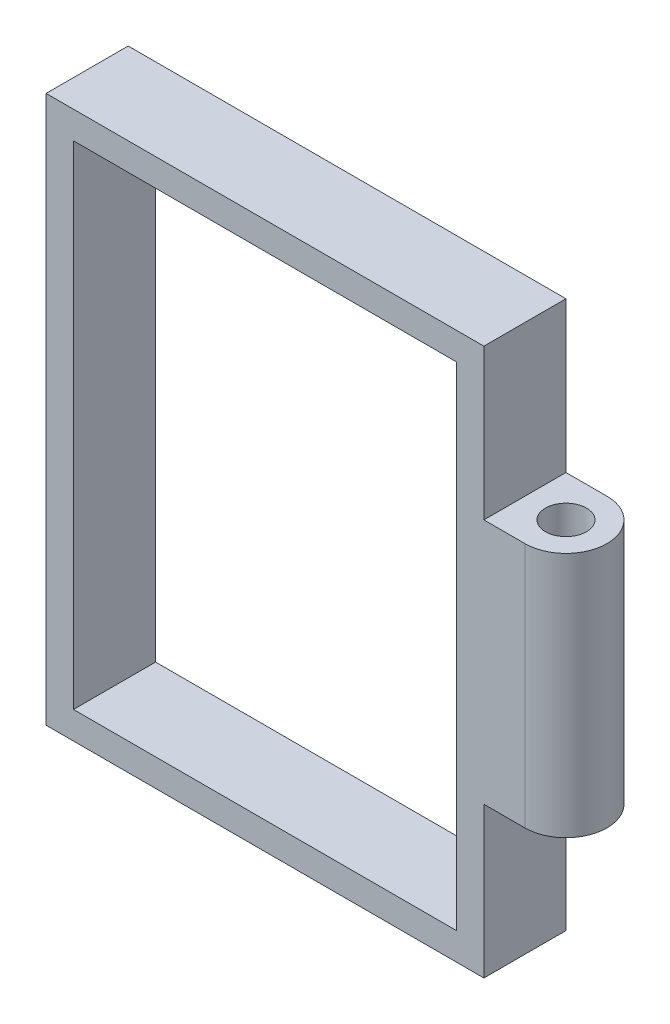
from build123d import *

# Parameters (mm, degrees)
CROQUIS1_W                   = 16
CROQUIS1_H                   = 3
SALIENTE_EXTRUIR1_DEPTH      = 20
SALIENTE_EXTRUIR2_DEPTH      = 4.5
SALIENTE_EXTRUIR2_DEPTH_BACK = 4.5
CROQUIS3_R                   = 0.75
CORTAR_EXTRUIR2_REACH        = 25.022
CROQUIS5_W                   = 14
CROQUIS5_H                   = 18


with BuildPart() as part:
    # Croquis1 → Saliente-Extruir1 (new body)
    with BuildSketch(Plane(origin=(0, 0, 0), x_dir=(1, 0, 0), z_dir=(0, 1, 0))):
        Rectangle(CROQUIS1_W, CROQUIS1_H)
    extrude(amount=SALIENTE_EXTRUIR1_DEPTH)

    # Croquis3 → Saliente-Extruir2 (add, two sides: drawn at the far end of the back side and taken through both)
    with BuildSketch(Plane(origin=(0, 10, 0), x_dir=(1, 0, 0), z_dir=(0, 1, 0)).offset(-SALIENTE_EXTRUIR2_DEPTH_BACK)):
        with BuildLine():
            Line((8, 1.5), (8, -1.5))
            Line((8, -1.5), (9.5, -1.5))
            ThreePointArc((9.5, -1.5), (11, 0), (9.5, 1.5))
            Line((9.5, 1.5), (8, 1.5))
        make_face()
        with Locations(Location((9.5, 0, 0), (0, 0, 270))):
            Circle(CROQUIS3_R, mode=Mode.SUBTRACT)
    extrude(amount=SALIENTE_EXTRUIR2_DEPTH + SALIENTE_EXTRUIR2_DEPTH_BACK)

    # Croquis5 → Cortar-Extruir2 (cut, up to next)
    with BuildSketch(Plane.XY.offset(1.5), mode=Mode.PRIVATE) as cortar_extruir2_sk1:
        with Locations((0, 10)):
            Rectangle(CROQUIS5_W, CROQUIS5_H)
    cortar_extruir2_tool1 = extrude(cortar_extruir2_sk1.sketch, amount=-CORTAR_EXTRUIR2_REACH, mode=Mode.PRIVATE) & part.part
    add(cortar_extruir2_tool1.solids().sort_by_distance((0, 10, 1.5))[0], mode=Mode.SUBTRACT)


solid = part.part
